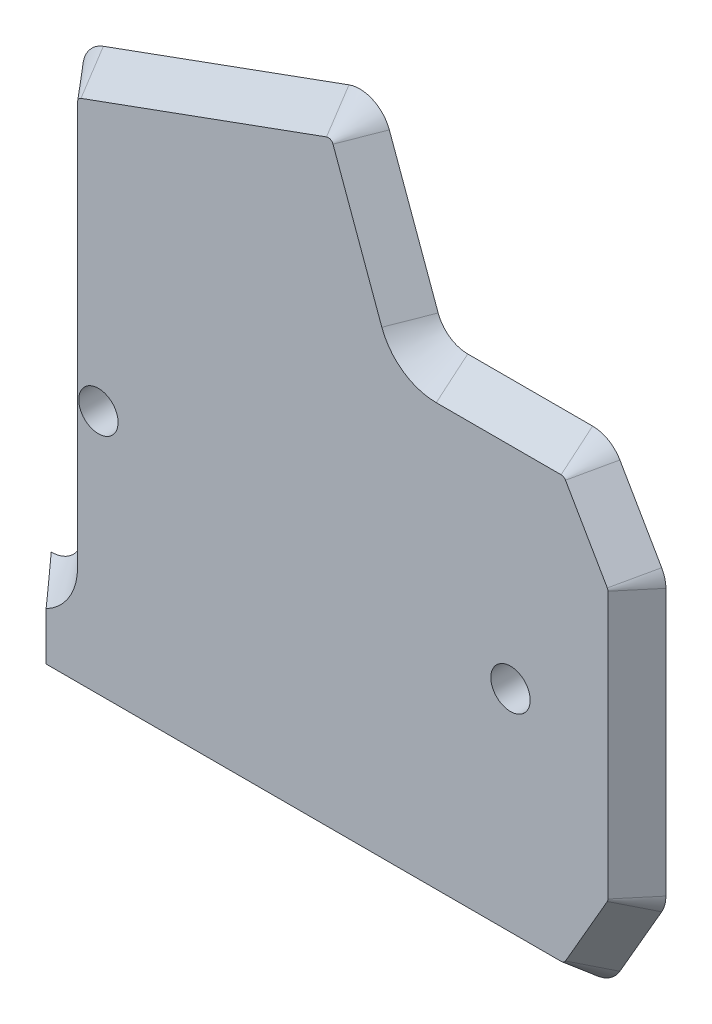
ISO-10303-21;
HEADER;
FILE_DESCRIPTION(('STEP AP214'),'2;1');
FILE_NAME('part.step','',(''),(''),'','','');
FILE_SCHEMA(('AUTOMOTIVE_DESIGN { 1 0 10303 214 1 1 1 1 }'));
ENDSEC;
DATA;
#1=APPLICATION_CONTEXT('core data for automotive mechanical design processes');
#2=APPLICATION_PROTOCOL_DEFINITION('international standard','automotive_design',2000,#1);
#3=PRODUCT_CONTEXT('',#1,'mechanical');
#4=PRODUCT('Part','Part','',(#3));
#5=PRODUCT_RELATED_PRODUCT_CATEGORY('part','',(#4));
#6=PRODUCT_DEFINITION_FORMATION('','',#4);
#7=PRODUCT_DEFINITION_CONTEXT('part definition',#1,'design');
#8=PRODUCT_DEFINITION('design','',#6,#7);
#9=PRODUCT_DEFINITION_SHAPE('','',#8);
#10=(LENGTH_UNIT() NAMED_UNIT(*) SI_UNIT(.MILLI.,.METRE.));
#11=(NAMED_UNIT(*) PLANE_ANGLE_UNIT() SI_UNIT($,.RADIAN.));
#12=(NAMED_UNIT(*) SI_UNIT($,.STERADIAN.) SOLID_ANGLE_UNIT());
#13=UNCERTAINTY_MEASURE_WITH_UNIT(LENGTH_MEASURE(1.E-05),#10,'distance_accuracy_value','');
#14=(GEOMETRIC_REPRESENTATION_CONTEXT(3) GLOBAL_UNCERTAINTY_ASSIGNED_CONTEXT((#13)) GLOBAL_UNIT_ASSIGNED_CONTEXT((#10,
#11,#12)) REPRESENTATION_CONTEXT('',''));
#15=CARTESIAN_POINT('',(0.,0.,0.));
#16=DIRECTION('',(0.,0.,1.));
#17=DIRECTION('',(1.,0.,0.));
#18=AXIS2_PLACEMENT_3D('',#15,#16,#17);
#19=CARTESIAN_POINT('',(25.5,2.,0.));
#20=DIRECTION('',(0.,0.,1.));
#21=DIRECTION('',(1.,0.,0.));
#22=AXIS2_PLACEMENT_3D('',#19,#20,#21);
#23=CONICAL_SURFACE('',#22,2.,0.698131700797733);
#24=CARTESIAN_POINT('',(25.5,2.,0.));
#25=DIRECTION('',(0.,0.,-1.));
#26=DIRECTION('',(1.,0.,0.));
#27=AXIS2_PLACEMENT_3D('',#24,#25,#26);
#28=CIRCLE('',#27,2.);
#29=CARTESIAN_POINT('',(27.5,2.,0.));
#30=VERTEX_POINT('',#29);
#31=CARTESIAN_POINT('',(25.5,0.,0.));
#32=VERTEX_POINT('',#31);
#33=EDGE_CURVE('E159',#30,#32,#28,.T.);
#34=ORIENTED_EDGE('',*,*,#33,.T.);
#35=CARTESIAN_POINT('',(27.1781992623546,-1.27304094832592,2.));
#36=CARTESIAN_POINT('',(27.1056653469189,-1.2287153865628,1.91355744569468));
#37=CARTESIAN_POINT('',(27.0333281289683,-1.1836181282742,1.8273493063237));
#38=CARTESIAN_POINT('',(26.8891064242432,-1.09168875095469,1.6554725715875));
#39=CARTESIAN_POINT('',(26.8172219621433,-1.04485653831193,1.56980400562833));
#40=CARTESIAN_POINT('',(26.6026748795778,-0.901695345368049,1.31411674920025));
#41=CARTESIAN_POINT('',(26.4607874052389,-0.80250149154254,1.14502184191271));
#42=CARTESIAN_POINT('',(26.2500717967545,-0.646315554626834,0.893900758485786));
#43=CARTESIAN_POINT('',(26.1801239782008,-0.592969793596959,0.810540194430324));
#44=CARTESIAN_POINT('',(26.0411505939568,-0.483465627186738,0.644918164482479));
#45=CARTESIAN_POINT('',(25.9721249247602,-0.427307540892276,0.562656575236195));
#46=CARTESIAN_POINT('',(25.8350472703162,-0.311614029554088,0.399293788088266));
#47=CARTESIAN_POINT('',(25.7669977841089,-0.252071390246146,0.318195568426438));
#48=CARTESIAN_POINT('',(25.6323328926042,-0.129098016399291,0.157708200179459));
#49=CARTESIAN_POINT('',(25.5657180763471,-0.0656657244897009,0.0783197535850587));
#50=CARTESIAN_POINT('',(25.5,0.,0.));
#51=B_SPLINE_CURVE_WITH_KNOTS('',3,(#35,#36,#37,#38,#39,#40,#41,#42,#43,#44,#45,#46,#47,#48,#49,
#50),.UNSPECIFIED.,.F.,.F.,(4,2,2,2,2,2,2,4),(0.,0.363698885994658,0.727417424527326,
1.45319687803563,1.81674036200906,2.18024269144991,2.54455122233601,2.90900658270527),.UNSPECIFIED.);
#52=CARTESIAN_POINT('',(27.1781992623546,-1.27304094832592,2.));
#53=VERTEX_POINT('',#52);
#54=EDGE_CURVE('E11',#53,#32,#51,.T.);
#55=ORIENTED_EDGE('',*,*,#54,.F.);
#56=CARTESIAN_POINT('',(25.5,2.,2.));
#57=DIRECTION('',(0.,0.,1.));
#58=DIRECTION('',(1.,0.,0.));
#59=AXIS2_PLACEMENT_3D('',#56,#57,#58);
#60=CIRCLE('',#59,3.67819926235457);
#61=CARTESIAN_POINT('',(29.1781992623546,2.,2.));
#62=VERTEX_POINT('',#61);
#63=EDGE_CURVE('E209',#62,#53,#60,.F.);
#64=ORIENTED_EDGE('',*,*,#63,.F.);
#65=DIRECTION('',(-0.64278760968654,0.,-0.766044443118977));
#66=VECTOR('',#65,1.);
#67=CARTESIAN_POINT('',(27.5,2.,0.));
#68=LINE('',#67,#66);
#69=EDGE_CURVE('E172',#62,#30,#68,.T.);
#70=ORIENTED_EDGE('',*,*,#69,.T.);
#71=EDGE_LOOP('',(#34,#55,#64,#70));
#72=FACE_BOUND('',#71,.T.);
#73=ADVANCED_FACE('F35',(#72),#23,.F.);
#74=CARTESIAN_POINT('',(25.5,0.,0.));
#75=DIRECTION('',(-0.766044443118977,0.,0.64278760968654));
#76=DIRECTION('',(0.64278760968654,0.,0.766044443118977));
#77=AXIS2_PLACEMENT_3D('',#74,#75,#76);
#78=PLANE('',#77);
#79=DIRECTION('',(0.,-1.,0.));
#80=VECTOR('',#79,1.);
#81=CARTESIAN_POINT('',(25.5,0.,0.));
#82=LINE('',#81,#80);
#83=CARTESIAN_POINT('',(25.5,-6.,0.));
#84=VERTEX_POINT('',#83);
#85=EDGE_CURVE('E155',#32,#84,#82,.T.);
#86=ORIENTED_EDGE('',*,*,#85,.T.);
#87=DIRECTION('',(-0.540716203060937,-0.540716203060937,-0.644400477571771));
#88=VECTOR('',#87,1.);
#89=CARTESIAN_POINT('',(26.4282821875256,-5.0717178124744,1.10628363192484));
#90=LINE('',#89,#88);
#91=CARTESIAN_POINT('',(27.1781992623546,-4.32180073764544,2.));
#92=VERTEX_POINT('',#91);
#93=EDGE_CURVE('E44',#92,#84,#90,.T.);
#94=ORIENTED_EDGE('',*,*,#93,.F.);
#95=DIRECTION('',(0.,1.,0.));
#96=VECTOR('',#95,1.);
#97=CARTESIAN_POINT('',(27.1781992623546,0.,2.));
#98=LINE('',#97,#96);
#99=EDGE_CURVE('E168',#53,#92,#98,.F.);
#100=ORIENTED_EDGE('',*,*,#99,.F.);
#101=ORIENTED_EDGE('',*,*,#54,.T.);
#102=EDGE_LOOP('',(#86,#94,#100,#101));
#103=FACE_BOUND('',#102,.T.);
#104=ADVANCED_FACE('F167',(#103),#78,.T.);
#105=CARTESIAN_POINT('',(28.6749818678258,-6.,0.));
#106=DIRECTION('',(0.,-0.766044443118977,0.64278760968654));
#107=DIRECTION('',(0.,-0.64278760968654,-0.766044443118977));
#108=AXIS2_PLACEMENT_3D('',#105,#106,#107);
#109=PLANE('',#108);
#110=DIRECTION('',(1.,0.,0.));
#111=VECTOR('',#110,1.);
#112=CARTESIAN_POINT('',(28.6749818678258,-6.,0.));
#113=LINE('',#112,#111);
#114=CARTESIAN_POINT('',(59.8894185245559,-6.,0.));
#115=VERTEX_POINT('',#114);
#116=EDGE_CURVE('E161',#84,#115,#113,.T.);
#117=ORIENTED_EDGE('',*,*,#116,.T.);
#118=DIRECTION('',(0.,-0.64278760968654,-0.766044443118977));
#119=VECTOR('',#118,1.);
#120=CARTESIAN_POINT('',(59.8894185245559,-6.,0.));
#121=LINE('',#120,#119);
#122=CARTESIAN_POINT('',(59.8894185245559,-4.32180073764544,2.));
#123=VERTEX_POINT('',#122);
#124=EDGE_CURVE('E288',#123,#115,#121,.T.);
#125=ORIENTED_EDGE('',*,*,#124,.F.);
#126=DIRECTION('',(-1.,0.,0.));
#127=VECTOR('',#126,1.);
#128=CARTESIAN_POINT('',(28.6749818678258,-4.32180073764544,2.));
#129=LINE('',#128,#127);
#130=EDGE_CURVE('E317',#92,#123,#129,.F.);
#131=ORIENTED_EDGE('',*,*,#130,.F.);
#132=ORIENTED_EDGE('',*,*,#93,.T.);
#133=EDGE_LOOP('',(#117,#125,#131,#132));
#134=FACE_BOUND('',#133,.T.);
#135=ADVANCED_FACE('F37',(#134),#109,.T.);
#136=CARTESIAN_POINT('',(59.8894185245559,-4.,0.));
#137=DIRECTION('',(0.,0.,-1.));
#138=DIRECTION('',(1.,0.,0.));
#139=AXIS2_PLACEMENT_3D('',#136,#137,#138);
#140=CONICAL_SURFACE('',#139,2.,0.698131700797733);
#141=CARTESIAN_POINT('',(59.8894185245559,-4.,0.));
#142=DIRECTION('',(0.,0.,1.));
#143=DIRECTION('',(1.,0.,0.));
#144=AXIS2_PLACEMENT_3D('',#141,#142,#143);
#145=CIRCLE('',#144,2.);
#146=CARTESIAN_POINT('',(61.6214693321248,-4.99999999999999,0.));
#147=VERTEX_POINT('',#146);
#148=EDGE_CURVE('E181',#115,#147,#145,.T.);
#149=ORIENTED_EDGE('',*,*,#148,.T.);
#150=DIRECTION('',(0.556670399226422,-0.321393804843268,-0.766044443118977));
#151=VECTOR('',#150,1.);
#152=CARTESIAN_POINT('',(61.6214693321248,-4.99999999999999,0.));
#153=LINE('',#152,#151);
#154=CARTESIAN_POINT('',(60.1681061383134,-4.16090036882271,2.));
#155=VERTEX_POINT('',#154);
#156=EDGE_CURVE('E285',#155,#147,#153,.T.);
#157=ORIENTED_EDGE('',*,*,#156,.F.);
#158=CARTESIAN_POINT('',(59.8894185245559,-4.,2.));
#159=DIRECTION('',(0.,0.,1.));
#160=DIRECTION('',(1.,0.,0.));
#161=AXIS2_PLACEMENT_3D('',#158,#159,#160);
#162=CIRCLE('',#161,0.321800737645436);
#163=EDGE_CURVE('E319',#123,#155,#162,.T.);
#164=ORIENTED_EDGE('',*,*,#163,.F.);
#165=ORIENTED_EDGE('',*,*,#124,.T.);
#166=EDGE_LOOP('',(#149,#157,#164,#165));
#167=FACE_BOUND('',#166,.T.);
#168=ADVANCED_FACE('F273',(#167),#140,.T.);
#169=CARTESIAN_POINT('',(61.6214693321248,-4.99999999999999,0.));
#170=DIRECTION('',(0.663413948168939,-0.383022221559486,0.64278760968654));
#171=DIRECTION('',(0.695854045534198,0.,-0.718183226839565));
#172=AXIS2_PLACEMENT_3D('',#169,#170,#171);
#173=PLANE('',#172);
#174=DIRECTION('',(0.499999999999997,0.86602540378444,0.));
#175=VECTOR('',#174,1.);
#176=CARTESIAN_POINT('',(61.6214693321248,-4.99999999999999,0.));
#177=LINE('',#176,#175);
#178=CARTESIAN_POINT('',(64.276169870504,-0.401923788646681,0.));
#179=VERTEX_POINT('',#178);
#180=EDGE_CURVE('E183',#147,#179,#177,.T.);
#181=ORIENTED_EDGE('',*,*,#180,.T.);
#182=DIRECTION('',(0.556670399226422,-0.321393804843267,-0.766044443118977));
#183=VECTOR('',#182,1.);
#184=CARTESIAN_POINT('',(64.276169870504,-0.40192378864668,0.));
#185=LINE('',#184,#183);
#186=CARTESIAN_POINT('',(62.8228066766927,0.437175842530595,2.));
#187=VERTEX_POINT('',#186);
#188=EDGE_CURVE('E293',#187,#179,#185,.T.);
#189=ORIENTED_EDGE('',*,*,#188,.F.);
#190=DIRECTION('',(-0.499999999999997,-0.86602540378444,0.));
#191=VECTOR('',#190,1.);
#192=CARTESIAN_POINT('',(60.1681061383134,-4.16090036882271,2.));
#193=LINE('',#192,#191);
#194=EDGE_CURVE('E292',#155,#187,#193,.F.);
#195=ORIENTED_EDGE('',*,*,#194,.F.);
#196=ORIENTED_EDGE('',*,*,#156,.T.);
#197=EDGE_LOOP('',(#181,#189,#195,#196));
#198=FACE_BOUND('',#197,.T.);
#199=ADVANCED_FACE('F270',(#198),#173,.T.);
#200=CARTESIAN_POINT('',(62.5441190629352,0.598076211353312,0.));
#201=DIRECTION('',(0.,0.,-1.));
#202=DIRECTION('',(1.,0.,0.));
#203=AXIS2_PLACEMENT_3D('',#200,#201,#202);
#204=CONICAL_SURFACE('',#203,2.,0.698131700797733);
#205=CARTESIAN_POINT('',(62.5441190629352,0.598076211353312,0.));
#206=DIRECTION('',(0.,0.,1.));
#207=DIRECTION('',(1.,0.,0.));
#208=AXIS2_PLACEMENT_3D('',#205,#206,#207);
#209=CIRCLE('',#208,2.);
#210=CARTESIAN_POINT('',(64.5441190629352,0.598076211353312,0.));
#211=VERTEX_POINT('',#210);
#212=EDGE_CURVE('E185',#179,#211,#209,.T.);
#213=ORIENTED_EDGE('',*,*,#212,.T.);
#214=DIRECTION('',(0.642787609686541,0.,-0.766044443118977));
#215=VECTOR('',#214,1.);
#216=CARTESIAN_POINT('',(64.5441190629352,0.598076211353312,0.));
#217=LINE('',#216,#215);
#218=CARTESIAN_POINT('',(62.8659198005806,0.598076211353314,2.));
#219=VERTEX_POINT('',#218);
#220=EDGE_CURVE('E301',#219,#211,#217,.T.);
#221=ORIENTED_EDGE('',*,*,#220,.F.);
#222=CARTESIAN_POINT('',(62.5441190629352,0.598076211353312,2.));
#223=DIRECTION('',(0.,0.,1.));
#224=DIRECTION('',(1.,0.,0.));
#225=AXIS2_PLACEMENT_3D('',#222,#223,#224);
#226=CIRCLE('',#225,0.321800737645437);
#227=EDGE_CURVE('E322',#187,#219,#226,.T.);
#228=ORIENTED_EDGE('',*,*,#227,.F.);
#229=ORIENTED_EDGE('',*,*,#188,.T.);
#230=EDGE_LOOP('',(#213,#221,#228,#229));
#231=FACE_BOUND('',#230,.T.);
#232=ADVANCED_FACE('F266',(#231),#204,.T.);
#233=CARTESIAN_POINT('',(64.5441190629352,0.598076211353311,0.));
#234=DIRECTION('',(0.766044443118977,0.,0.64278760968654));
#235=DIRECTION('',(0.64278760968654,0.,-0.766044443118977));
#236=AXIS2_PLACEMENT_3D('',#233,#234,#235);
#237=PLANE('',#236);
#238=DIRECTION('',(0.,1.,0.));
#239=VECTOR('',#238,1.);
#240=CARTESIAN_POINT('',(64.5441190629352,0.598076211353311,0.));
#241=LINE('',#240,#239);
#242=CARTESIAN_POINT('',(64.5441190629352,17.5262794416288,0.));
#243=VERTEX_POINT('',#242);
#244=EDGE_CURVE('E187',#211,#243,#241,.T.);
#245=ORIENTED_EDGE('',*,*,#244,.T.);
#246=DIRECTION('',(0.64278760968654,0.,-0.766044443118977));
#247=VECTOR('',#246,1.);
#248=CARTESIAN_POINT('',(64.5441190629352,17.5262794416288,0.));
#249=LINE('',#248,#247);
#250=CARTESIAN_POINT('',(62.8659198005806,17.5262794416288,2.));
#251=VERTEX_POINT('',#250);
#252=EDGE_CURVE('E306',#251,#243,#249,.T.);
#253=ORIENTED_EDGE('',*,*,#252,.F.);
#254=DIRECTION('',(0.,-1.,0.));
#255=VECTOR('',#254,1.);
#256=CARTESIAN_POINT('',(62.8659198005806,0.598076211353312,2.));
#257=LINE('',#256,#255);
#258=EDGE_CURVE('E305',#219,#251,#257,.F.);
#259=ORIENTED_EDGE('',*,*,#258,.F.);
#260=ORIENTED_EDGE('',*,*,#220,.T.);
#261=EDGE_LOOP('',(#245,#253,#259,#260));
#262=FACE_BOUND('',#261,.T.);
#263=ADVANCED_FACE('F262',(#262),#237,.T.);
#264=CARTESIAN_POINT('',(62.5441190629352,17.5262794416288,0.));
#265=DIRECTION('',(0.,0.,-1.));
#266=DIRECTION('',(1.,0.,0.));
#267=AXIS2_PLACEMENT_3D('',#264,#265,#266);
#268=CONICAL_SURFACE('',#267,2.,0.698131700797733);
#269=CARTESIAN_POINT('',(62.5441190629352,17.5262794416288,0.));
#270=DIRECTION('',(0.,0.,1.));
#271=DIRECTION('',(1.,0.,0.));
#272=AXIS2_PLACEMENT_3D('',#269,#270,#271);
#273=CIRCLE('',#272,2.);
#274=CARTESIAN_POINT('',(64.276169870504,18.5262794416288,0.));
#275=VERTEX_POINT('',#274);
#276=EDGE_CURVE('E189',#243,#275,#273,.T.);
#277=ORIENTED_EDGE('',*,*,#276,.T.);
#278=DIRECTION('',(0.556670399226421,0.321393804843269,-0.766044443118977));
#279=VECTOR('',#278,1.);
#280=CARTESIAN_POINT('',(64.276169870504,18.5262794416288,0.));
#281=LINE('',#280,#279);
#282=CARTESIAN_POINT('',(62.8228066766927,17.6871798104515,2.));
#283=VERTEX_POINT('',#282);
#284=EDGE_CURVE('E309',#283,#275,#281,.T.);
#285=ORIENTED_EDGE('',*,*,#284,.F.);
#286=CARTESIAN_POINT('',(62.5441190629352,17.5262794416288,2.));
#287=DIRECTION('',(0.,0.,1.));
#288=DIRECTION('',(1.,0.,0.));
#289=AXIS2_PLACEMENT_3D('',#286,#287,#288);
#290=CIRCLE('',#289,0.321800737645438);
#291=EDGE_CURVE('E325',#251,#283,#290,.T.);
#292=ORIENTED_EDGE('',*,*,#291,.F.);
#293=ORIENTED_EDGE('',*,*,#252,.T.);
#294=EDGE_LOOP('',(#277,#285,#292,#293));
#295=FACE_BOUND('',#294,.T.);
#296=ADVANCED_FACE('F258',(#295),#268,.T.);
#297=CARTESIAN_POINT('',(64.276169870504,18.5262794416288,0.));
#298=DIRECTION('',(0.663413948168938,0.383022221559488,0.64278760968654));
#299=DIRECTION('',(0.695854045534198,0.,-0.718183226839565));
#300=AXIS2_PLACEMENT_3D('',#297,#298,#299);
#301=PLANE('',#300);
#302=DIRECTION('',(-0.499999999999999,0.866025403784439,0.));
#303=VECTOR('',#302,1.);
#304=CARTESIAN_POINT('',(64.276169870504,18.5262794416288,0.));
#305=LINE('',#304,#303);
#306=CARTESIAN_POINT('',(61.6214693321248,23.1243556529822,0.));
#307=VERTEX_POINT('',#306);
#308=EDGE_CURVE('E191',#275,#307,#305,.T.);
#309=ORIENTED_EDGE('',*,*,#308,.T.);
#310=DIRECTION('',(0.556670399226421,0.321393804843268,-0.766044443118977));
#311=VECTOR('',#310,1.);
#312=CARTESIAN_POINT('',(61.6214693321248,23.1243556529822,0.));
#313=LINE('',#312,#311);
#314=CARTESIAN_POINT('',(60.1681061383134,22.2852560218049,2.));
#315=VERTEX_POINT('',#314);
#316=EDGE_CURVE('E361',#315,#307,#313,.T.);
#317=ORIENTED_EDGE('',*,*,#316,.F.);
#318=DIRECTION('',(0.499999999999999,-0.866025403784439,0.));
#319=VECTOR('',#318,1.);
#320=CARTESIAN_POINT('',(62.8228066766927,17.6871798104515,2.));
#321=LINE('',#320,#319);
#322=EDGE_CURVE('E327',#283,#315,#321,.F.);
#323=ORIENTED_EDGE('',*,*,#322,.F.);
#324=ORIENTED_EDGE('',*,*,#284,.T.);
#325=EDGE_LOOP('',(#309,#317,#323,#324));
#326=FACE_BOUND('',#325,.T.);
#327=ADVANCED_FACE('F254',(#326),#301,.T.);
#328=CARTESIAN_POINT('',(59.8894185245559,22.1243556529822,0.));
#329=DIRECTION('',(0.,0.,-1.));
#330=DIRECTION('',(1.,0.,0.));
#331=AXIS2_PLACEMENT_3D('',#328,#329,#330);
#332=CONICAL_SURFACE('',#331,2.,0.698131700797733);
#333=CARTESIAN_POINT('',(59.8894185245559,22.1243556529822,0.));
#334=DIRECTION('',(0.,0.,1.));
#335=DIRECTION('',(1.,0.,0.));
#336=AXIS2_PLACEMENT_3D('',#333,#334,#335);
#337=CIRCLE('',#336,2.);
#338=CARTESIAN_POINT('',(59.8894185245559,24.1243556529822,0.));
#339=VERTEX_POINT('',#338);
#340=EDGE_CURVE('E193',#307,#339,#337,.T.);
#341=ORIENTED_EDGE('',*,*,#340,.T.);
#342=DIRECTION('',(0.,0.642787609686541,-0.766044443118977));
#343=VECTOR('',#342,1.);
#344=CARTESIAN_POINT('',(59.8894185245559,24.1243556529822,0.));
#345=LINE('',#344,#343);
#346=CARTESIAN_POINT('',(59.8894185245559,22.4461563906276,2.));
#347=VERTEX_POINT('',#346);
#348=EDGE_CURVE('E358',#347,#339,#345,.T.);
#349=ORIENTED_EDGE('',*,*,#348,.F.);
#350=CARTESIAN_POINT('',(59.8894185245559,22.1243556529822,2.));
#351=DIRECTION('',(0.,0.,1.));
#352=DIRECTION('',(1.,0.,0.));
#353=AXIS2_PLACEMENT_3D('',#350,#351,#352);
#354=CIRCLE('',#353,0.321800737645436);
#355=EDGE_CURVE('E329',#315,#347,#354,.T.);
#356=ORIENTED_EDGE('',*,*,#355,.F.);
#357=ORIENTED_EDGE('',*,*,#316,.T.);
#358=EDGE_LOOP('',(#341,#349,#356,#357));
#359=FACE_BOUND('',#358,.T.);
#360=ADVANCED_FACE('F250',(#359),#332,.T.);
#361=CARTESIAN_POINT('',(59.8894185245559,24.1243556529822,0.));
#362=DIRECTION('',(0.,0.766044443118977,0.64278760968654));
#363=DIRECTION('',(0.,-0.64278760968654,0.766044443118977));
#364=AXIS2_PLACEMENT_3D('',#361,#362,#363);
#365=PLANE('',#364);
#366=DIRECTION('',(-1.,0.,0.));
#367=VECTOR('',#366,1.);
#368=CARTESIAN_POINT('',(59.8894185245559,24.1243556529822,0.));
#369=LINE('',#368,#367);
#370=CARTESIAN_POINT('',(51.9585599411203,24.1243556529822,0.));
#371=VERTEX_POINT('',#370);
#372=EDGE_CURVE('E195',#339,#371,#369,.T.);
#373=ORIENTED_EDGE('',*,*,#372,.T.);
#374=DIRECTION('',(0.,0.64278760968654,-0.766044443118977));
#375=VECTOR('',#374,1.);
#376=CARTESIAN_POINT('',(51.9585599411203,24.1243556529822,0.));
#377=LINE('',#376,#375);
#378=CARTESIAN_POINT('',(51.9585599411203,22.4461563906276,2.));
#379=VERTEX_POINT('',#378);
#380=EDGE_CURVE('E355',#379,#371,#377,.T.);
#381=ORIENTED_EDGE('',*,*,#380,.F.);
#382=DIRECTION('',(1.,0.,0.));
#383=VECTOR('',#382,1.);
#384=CARTESIAN_POINT('',(59.8894185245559,22.4461563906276,2.));
#385=LINE('',#384,#383);
#386=EDGE_CURVE('E331',#347,#379,#385,.F.);
#387=ORIENTED_EDGE('',*,*,#386,.F.);
#388=ORIENTED_EDGE('',*,*,#348,.T.);
#389=EDGE_LOOP('',(#373,#381,#387,#388));
#390=FACE_BOUND('',#389,.T.);
#391=ADVANCED_FACE('F246',(#390),#365,.T.);
#392=CARTESIAN_POINT('',(51.9585599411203,26.1243556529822,0.));
#393=DIRECTION('',(0.,0.,1.));
#394=DIRECTION('',(1.,0.,0.));
#395=AXIS2_PLACEMENT_3D('',#392,#393,#394);
#396=CONICAL_SURFACE('',#395,2.,0.698131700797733);
#397=CARTESIAN_POINT('',(51.9585599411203,26.1243556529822,0.));
#398=DIRECTION('',(0.,0.,-1.));
#399=DIRECTION('',(1.,0.,0.));
#400=AXIS2_PLACEMENT_3D('',#397,#398,#399);
#401=CIRCLE('',#400,2.);
#402=CARTESIAN_POINT('',(50.0791746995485,25.4403153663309,0.));
#403=VERTEX_POINT('',#402);
#404=EDGE_CURVE('E197',#371,#403,#401,.T.);
#405=ORIENTED_EDGE('',*,*,#404,.T.);
#406=DIRECTION('',(0.604022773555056,0.219846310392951,-0.766044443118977));
#407=VECTOR('',#406,1.);
#408=CARTESIAN_POINT('',(50.0791746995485,25.4403153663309,0.));
#409=LINE('',#408,#407);
#410=CARTESIAN_POINT('',(48.5021832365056,24.8663374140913,2.));
#411=VERTEX_POINT('',#410);
#412=EDGE_CURVE('E352',#411,#403,#409,.T.);
#413=ORIENTED_EDGE('',*,*,#412,.F.);
#414=CARTESIAN_POINT('',(51.9585599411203,26.1243556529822,2.));
#415=DIRECTION('',(0.,0.,1.));
#416=DIRECTION('',(1.,0.,0.));
#417=AXIS2_PLACEMENT_3D('',#414,#415,#416);
#418=CIRCLE('',#417,3.67819926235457);
#419=EDGE_CURVE('E333',#379,#411,#418,.F.);
#420=ORIENTED_EDGE('',*,*,#419,.F.);
#421=ORIENTED_EDGE('',*,*,#380,.T.);
#422=EDGE_LOOP('',(#405,#413,#420,#421));
#423=FACE_BOUND('',#422,.T.);
#424=ADVANCED_FACE('F242',(#423),#396,.F.);
#425=CARTESIAN_POINT('',(50.0791746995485,25.4403153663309,0.));
#426=DIRECTION('',(0.719846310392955,0.26200263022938,0.64278760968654));
#427=DIRECTION('',(0.666054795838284,0.,-0.745902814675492));
#428=AXIS2_PLACEMENT_3D('',#425,#426,#427);
#429=PLANE('',#428);
#430=DIRECTION('',(-0.342020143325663,0.939692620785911,0.));
#431=VECTOR('',#430,1.);
#432=CARTESIAN_POINT('',(50.0791746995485,25.4403153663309,0.));
#433=LINE('',#432,#431);
#434=CARTESIAN_POINT('',(46.9778927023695,33.9610176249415,0.));
#435=VERTEX_POINT('',#434);
#436=EDGE_CURVE('E199',#403,#435,#433,.T.);
#437=ORIENTED_EDGE('',*,*,#436,.T.);
#438=DIRECTION('',(0.604022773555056,0.219846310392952,-0.766044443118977));
#439=VECTOR('',#438,1.);
#440=CARTESIAN_POINT('',(46.9778927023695,33.9610176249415,0.));
#441=LINE('',#440,#439);
#442=CARTESIAN_POINT('',(45.4009012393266,33.387039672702,2.));
#443=VERTEX_POINT('',#442);
#444=EDGE_CURVE('E349',#443,#435,#441,.T.);
#445=ORIENTED_EDGE('',*,*,#444,.F.);
#446=DIRECTION('',(0.342020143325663,-0.939692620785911,0.));
#447=VECTOR('',#446,1.);
#448=CARTESIAN_POINT('',(48.5021832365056,24.8663374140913,2.));
#449=LINE('',#448,#447);
#450=EDGE_CURVE('E335',#411,#443,#449,.F.);
#451=ORIENTED_EDGE('',*,*,#450,.F.);
#452=ORIENTED_EDGE('',*,*,#412,.T.);
#453=EDGE_LOOP('',(#437,#445,#451,#452));
#454=FACE_BOUND('',#453,.T.);
#455=ADVANCED_FACE('F238',(#454),#429,.T.);
#456=CARTESIAN_POINT('',(45.0985074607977,33.2769773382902,0.));
#457=DIRECTION('',(0.,0.,-1.));
#458=DIRECTION('',(1.,0.,0.));
#459=AXIS2_PLACEMENT_3D('',#456,#457,#458);
#460=CONICAL_SURFACE('',#459,2.,0.698131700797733);
#461=CARTESIAN_POINT('',(45.0985074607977,33.2769773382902,0.));
#462=DIRECTION('',(0.,0.,1.));
#463=DIRECTION('',(1.,0.,0.));
#464=AXIS2_PLACEMENT_3D('',#461,#462,#463);
#465=CIRCLE('',#464,2.);
#466=CARTESIAN_POINT('',(44.4144671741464,35.156362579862,0.));
#467=VERTEX_POINT('',#466);
#468=EDGE_CURVE('E201',#435,#467,#465,.T.);
#469=ORIENTED_EDGE('',*,*,#468,.T.);
#470=DIRECTION('',(-0.219846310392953,0.604022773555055,-0.766044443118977));
#471=VECTOR('',#470,1.);
#472=CARTESIAN_POINT('',(44.4144671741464,35.156362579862,0.));
#473=LINE('',#472,#471);
#474=CARTESIAN_POINT('',(44.9884451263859,33.5793711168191,2.));
#475=VERTEX_POINT('',#474);
#476=EDGE_CURVE('E344',#475,#467,#473,.T.);
#477=ORIENTED_EDGE('',*,*,#476,.F.);
#478=CARTESIAN_POINT('',(45.0985074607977,33.2769773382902,2.));
#479=DIRECTION('',(0.,0.,1.));
#480=DIRECTION('',(1.,0.,0.));
#481=AXIS2_PLACEMENT_3D('',#478,#479,#480);
#482=CIRCLE('',#481,0.321800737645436);
#483=EDGE_CURVE('E337',#443,#475,#482,.T.);
#484=ORIENTED_EDGE('',*,*,#483,.F.);
#485=ORIENTED_EDGE('',*,*,#444,.T.);
#486=EDGE_LOOP('',(#469,#477,#484,#485));
#487=FACE_BOUND('',#486,.T.);
#488=ADVANCED_FACE('F234',(#487),#460,.T.);
#489=CARTESIAN_POINT('',(44.4144671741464,35.156362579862,0.));
#490=DIRECTION('',(-0.262002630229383,0.719846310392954,0.64278760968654));
#491=DIRECTION('',(0.,-0.666054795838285,0.745902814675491));
#492=AXIS2_PLACEMENT_3D('',#489,#490,#491);
#493=PLANE('',#492);
#494=DIRECTION('',(-0.939692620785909,-0.342020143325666,0.));
#495=VECTOR('',#494,1.);
#496=CARTESIAN_POINT('',(44.4144671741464,35.156362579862,0.));
#497=LINE('',#496,#495);
#498=CARTESIAN_POINT('',(28.8159597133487,29.4789701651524,0.));
#499=VERTEX_POINT('',#498);
#500=EDGE_CURVE('E203',#467,#499,#497,.T.);
#501=ORIENTED_EDGE('',*,*,#500,.T.);
#502=DIRECTION('',(-0.219846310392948,0.604022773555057,-0.766044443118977));
#503=VECTOR('',#502,1.);
#504=CARTESIAN_POINT('',(28.8159597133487,29.4789701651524,0.));
#505=LINE('',#504,#503);
#506=CARTESIAN_POINT('',(29.3899376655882,27.9019787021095,2.));
#507=VERTEX_POINT('',#506);
#508=EDGE_CURVE('E342',#507,#499,#505,.T.);
#509=ORIENTED_EDGE('',*,*,#508,.F.);
#510=DIRECTION('',(0.939692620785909,0.342020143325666,0.));
#511=VECTOR('',#510,1.);
#512=CARTESIAN_POINT('',(44.9884451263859,33.5793711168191,2.));
#513=LINE('',#512,#511);
#514=EDGE_CURVE('E339',#475,#507,#513,.F.);
#515=ORIENTED_EDGE('',*,*,#514,.F.);
#516=ORIENTED_EDGE('',*,*,#476,.T.);
#517=EDGE_LOOP('',(#501,#509,#515,#516));
#518=FACE_BOUND('',#517,.T.);
#519=ADVANCED_FACE('F230',(#518),#493,.T.);
#520=CARTESIAN_POINT('',(29.5,27.5995849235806,0.));
#521=DIRECTION('',(0.,0.,-1.));
#522=DIRECTION('',(1.,0.,0.));
#523=AXIS2_PLACEMENT_3D('',#520,#521,#522);
#524=CONICAL_SURFACE('',#523,2.,0.698131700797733);
#525=CARTESIAN_POINT('',(29.5,27.5995849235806,0.));
#526=DIRECTION('',(0.,0.,1.));
#527=DIRECTION('',(1.,0.,0.));
#528=AXIS2_PLACEMENT_3D('',#525,#526,#527);
#529=CIRCLE('',#528,2.);
#530=CARTESIAN_POINT('',(27.5,27.5995849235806,0.));
#531=VERTEX_POINT('',#530);
#532=EDGE_CURVE('E206',#499,#531,#529,.T.);
#533=ORIENTED_EDGE('',*,*,#532,.T.);
#534=DIRECTION('',(-0.642787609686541,0.,-0.766044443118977));
#535=VECTOR('',#534,1.);
#536=CARTESIAN_POINT('',(27.5,27.5995849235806,0.));
#537=LINE('',#536,#535);
#538=CARTESIAN_POINT('',(29.1781992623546,27.5995849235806,2.));
#539=VERTEX_POINT('',#538);
#540=EDGE_CURVE('E340',#539,#531,#537,.T.);
#541=ORIENTED_EDGE('',*,*,#540,.F.);
#542=CARTESIAN_POINT('',(29.5,27.5995849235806,2.));
#543=DIRECTION('',(0.,0.,1.));
#544=DIRECTION('',(1.,0.,0.));
#545=AXIS2_PLACEMENT_3D('',#542,#543,#544);
#546=CIRCLE('',#545,0.321800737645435);
#547=EDGE_CURVE('E56',#507,#539,#546,.T.);
#548=ORIENTED_EDGE('',*,*,#547,.F.);
#549=ORIENTED_EDGE('',*,*,#508,.T.);
#550=EDGE_LOOP('',(#533,#541,#548,#549));
#551=FACE_BOUND('',#550,.T.);
#552=ADVANCED_FACE('F226',(#551),#524,.T.);
#553=CARTESIAN_POINT('',(27.5,27.5995849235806,0.));
#554=DIRECTION('',(-0.766044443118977,0.,0.64278760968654));
#555=DIRECTION('',(0.64278760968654,0.,0.766044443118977));
#556=AXIS2_PLACEMENT_3D('',#553,#554,#555);
#557=PLANE('',#556);
#558=DIRECTION('',(0.,-1.,0.));
#559=VECTOR('',#558,1.);
#560=CARTESIAN_POINT('',(27.5,27.5995849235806,0.));
#561=LINE('',#560,#559);
#562=EDGE_CURVE('E208',#531,#30,#561,.T.);
#563=ORIENTED_EDGE('',*,*,#562,.T.);
#564=ORIENTED_EDGE('',*,*,#69,.F.);
#565=DIRECTION('',(0.,1.,0.));
#566=VECTOR('',#565,1.);
#567=CARTESIAN_POINT('',(29.1781992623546,27.5995849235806,2.));
#568=LINE('',#567,#566);
#569=EDGE_CURVE('E39',#539,#62,#568,.F.);
#570=ORIENTED_EDGE('',*,*,#569,.F.);
#571=ORIENTED_EDGE('',*,*,#540,.T.);
#572=EDGE_LOOP('',(#563,#564,#570,#571));
#573=FACE_BOUND('',#572,.T.);
#574=ADVANCED_FACE('F222',(#573),#557,.T.);
#575=CARTESIAN_POINT('',(25.5,2.,2.));
#576=DIRECTION('',(0.,0.,1.));
#577=DIRECTION('',(1.,0.,0.));
#578=AXIS2_PLACEMENT_3D('',#575,#576,#577);
#579=PLANE('',#578);
#580=CARTESIAN_POINT('',(56.6749818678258,9.06217782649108,2.));
#581=DIRECTION('',(0.,0.,1.));
#582=DIRECTION('',(1.,0.,0.));
#583=AXIS2_PLACEMENT_3D('',#580,#581,#582);
#584=CIRCLE('',#583,1.24999999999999);
#585=CARTESIAN_POINT('',(57.9249818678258,9.06217782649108,2.));
#586=VERTEX_POINT('',#585);
#587=EDGE_CURVE('E412',#586,#586,#584,.T.);
#588=ORIENTED_EDGE('',*,*,#587,.F.);
#589=EDGE_LOOP('',(#588));
#590=FACE_BOUND('',#589,.T.);
#591=CARTESIAN_POINT('',(30.5,11.2558549,2.));
#592=DIRECTION('',(0.,0.,1.));
#593=DIRECTION('',(1.,0.,0.));
#594=AXIS2_PLACEMENT_3D('',#591,#592,#593);
#595=CIRCLE('',#594,1.24999999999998);
#596=CARTESIAN_POINT('',(31.75,11.2558549,2.));
#597=VERTEX_POINT('',#596);
#598=EDGE_CURVE('E176',#597,#597,#595,.T.);
#599=ORIENTED_EDGE('',*,*,#598,.F.);
#600=EDGE_LOOP('',(#599));
#601=FACE_BOUND('',#600,.T.);
#602=ORIENTED_EDGE('',*,*,#63,.T.);
#603=ORIENTED_EDGE('',*,*,#99,.T.);
#604=ORIENTED_EDGE('',*,*,#130,.T.);
#605=ORIENTED_EDGE('',*,*,#163,.T.);
#606=ORIENTED_EDGE('',*,*,#194,.T.);
#607=ORIENTED_EDGE('',*,*,#227,.T.);
#608=ORIENTED_EDGE('',*,*,#258,.T.);
#609=ORIENTED_EDGE('',*,*,#291,.T.);
#610=ORIENTED_EDGE('',*,*,#322,.T.);
#611=ORIENTED_EDGE('',*,*,#355,.T.);
#612=ORIENTED_EDGE('',*,*,#386,.T.);
#613=ORIENTED_EDGE('',*,*,#419,.T.);
#614=ORIENTED_EDGE('',*,*,#450,.T.);
#615=ORIENTED_EDGE('',*,*,#483,.T.);
#616=ORIENTED_EDGE('',*,*,#514,.T.);
#617=ORIENTED_EDGE('',*,*,#547,.T.);
#618=ORIENTED_EDGE('',*,*,#569,.T.);
#619=EDGE_LOOP('',(#602,#603,#604,#605,#606,#607,#608,#609,#610,#611,#612,#613,#614,#615,#616,
#617,#618));
#620=FACE_BOUND('',#619,.T.);
#621=ADVANCED_FACE('F225',(#590,#601,#620),#579,.T.);
#622=CARTESIAN_POINT('',(25.5,2.,0.));
#623=DIRECTION('',(0.,0.,1.));
#624=DIRECTION('',(1.,0.,0.));
#625=AXIS2_PLACEMENT_3D('',#622,#623,#624);
#626=PLANE('',#625);
#627=CARTESIAN_POINT('',(56.6749818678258,9.06217782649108,0.));
#628=DIRECTION('',(0.,0.,1.));
#629=DIRECTION('',(1.,0.,0.));
#630=AXIS2_PLACEMENT_3D('',#627,#628,#629);
#631=CIRCLE('',#630,1.25);
#632=CARTESIAN_POINT('',(57.9249818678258,9.06217782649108,0.));
#633=VERTEX_POINT('',#632);
#634=EDGE_CURVE('E410',#633,#633,#631,.T.);
#635=ORIENTED_EDGE('',*,*,#634,.T.);
#636=EDGE_LOOP('',(#635));
#637=FACE_BOUND('',#636,.T.);
#638=CARTESIAN_POINT('',(30.5,11.2558549,0.));
#639=DIRECTION('',(0.,0.,1.));
#640=DIRECTION('',(1.,0.,0.));
#641=AXIS2_PLACEMENT_3D('',#638,#639,#640);
#642=CIRCLE('',#641,1.25);
#643=CARTESIAN_POINT('',(31.75,11.2558549,0.));
#644=VERTEX_POINT('',#643);
#645=EDGE_CURVE('E173',#644,#644,#642,.T.);
#646=ORIENTED_EDGE('',*,*,#645,.T.);
#647=EDGE_LOOP('',(#646));
#648=FACE_BOUND('',#647,.T.);
#649=ORIENTED_EDGE('',*,*,#33,.F.);
#650=ORIENTED_EDGE('',*,*,#562,.F.);
#651=ORIENTED_EDGE('',*,*,#532,.F.);
#652=ORIENTED_EDGE('',*,*,#500,.F.);
#653=ORIENTED_EDGE('',*,*,#468,.F.);
#654=ORIENTED_EDGE('',*,*,#436,.F.);
#655=ORIENTED_EDGE('',*,*,#404,.F.);
#656=ORIENTED_EDGE('',*,*,#372,.F.);
#657=ORIENTED_EDGE('',*,*,#340,.F.);
#658=ORIENTED_EDGE('',*,*,#308,.F.);
#659=ORIENTED_EDGE('',*,*,#276,.F.);
#660=ORIENTED_EDGE('',*,*,#244,.F.);
#661=ORIENTED_EDGE('',*,*,#212,.F.);
#662=ORIENTED_EDGE('',*,*,#180,.F.);
#663=ORIENTED_EDGE('',*,*,#148,.F.);
#664=ORIENTED_EDGE('',*,*,#116,.F.);
#665=ORIENTED_EDGE('',*,*,#85,.F.);
#666=EDGE_LOOP('',(#649,#650,#651,#652,#653,#654,#655,#656,#657,#658,#659,#660,#661,#662,#663,
#664,#665));
#667=FACE_BOUND('',#666,.T.);
#668=ADVANCED_FACE('F156',(#637,#648,#667),#626,.F.);
#669=CARTESIAN_POINT('',(30.5,11.2558549,2.));
#670=DIRECTION('',(0.,0.,1.));
#671=DIRECTION('',(1.,0.,0.));
#672=AXIS2_PLACEMENT_3D('',#669,#670,#671);
#673=CYLINDRICAL_SURFACE('',#672,1.24999999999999);
#674=ORIENTED_EDGE('',*,*,#645,.F.);
#675=EDGE_LOOP('',(#674));
#676=FACE_BOUND('',#675,.T.);
#677=ORIENTED_EDGE('',*,*,#598,.T.);
#678=EDGE_LOOP('',(#677));
#679=FACE_BOUND('',#678,.T.);
#680=ADVANCED_FACE('F394',(#676,#679),#673,.F.);
#681=CARTESIAN_POINT('',(56.6749818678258,9.06217782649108,2.));
#682=DIRECTION('',(0.,0.,1.));
#683=DIRECTION('',(1.,0.,0.));
#684=AXIS2_PLACEMENT_3D('',#681,#682,#683);
#685=CYLINDRICAL_SURFACE('',#684,1.24999999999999);
#686=ORIENTED_EDGE('',*,*,#634,.F.);
#687=EDGE_LOOP('',(#686));
#688=FACE_BOUND('',#687,.T.);
#689=ORIENTED_EDGE('',*,*,#587,.T.);
#690=EDGE_LOOP('',(#689));
#691=FACE_BOUND('',#690,.T.);
#692=ADVANCED_FACE('F401',(#688,#691),#685,.F.);
#693=CLOSED_SHELL('',(#73,#104,#135,#168,#199,#232,#263,#296,#327,#360,#391,#424,#455,#488,#519,
#552,#574,#621,#668,#680,#692));
#694=MANIFOLD_SOLID_BREP('B2',#693);
#695=ADVANCED_BREP_SHAPE_REPRESENTATION('',(#18,#694),#14);
#696=SHAPE_DEFINITION_REPRESENTATION(#9,#695);
ENDSEC;
END-ISO-10303-21;
